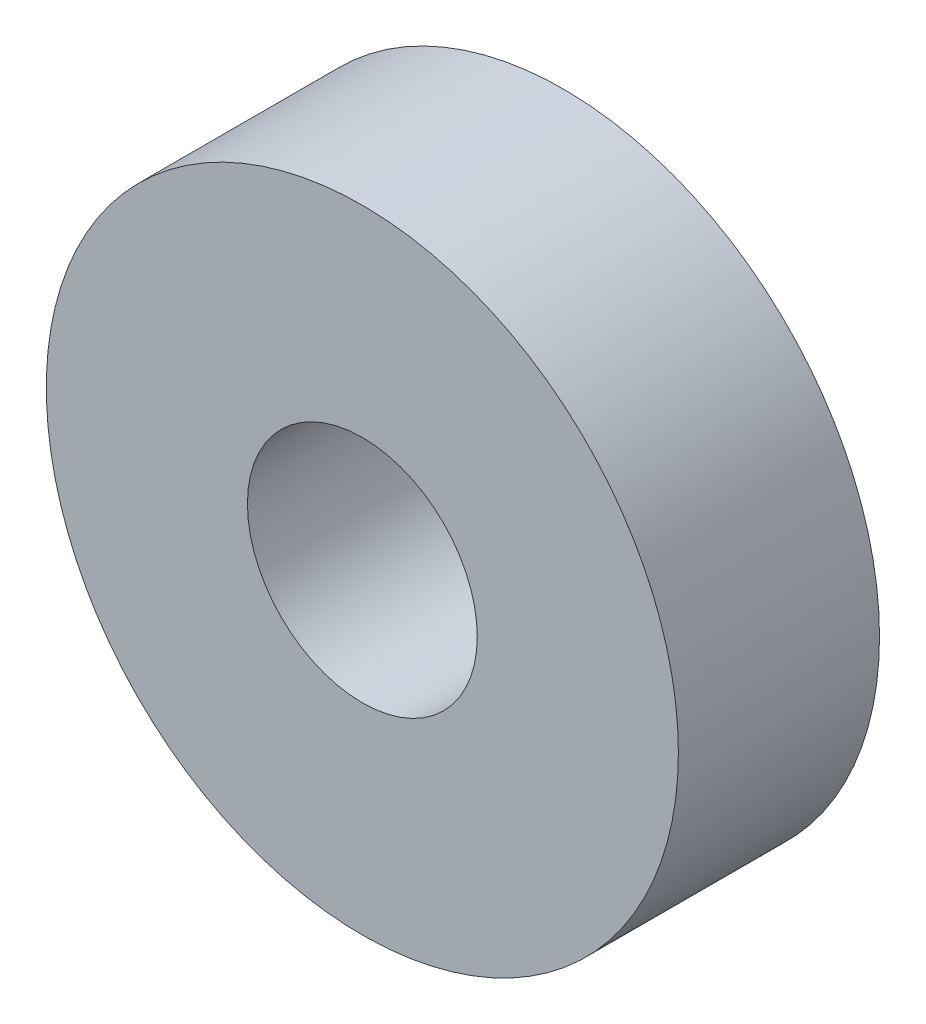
from build123d import *

# Parameters (mm, degrees)
SKETCH1_R           = 11
SKETCH1_R_2         = 4
BOSS_EXTRUDE1_DEPTH = 7


with BuildPart() as part:
    # Sketch1 → Boss-Extrude1 (new body)
    with BuildSketch(Plane.XY):
        with Locations((-129.774280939, -311.683903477)):
            Circle(SKETCH1_R)
        with Locations((-129.774280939, -311.683903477)):
            Circle(SKETCH1_R_2, mode=Mode.SUBTRACT)
    extrude(amount=BOSS_EXTRUDE1_DEPTH)


solid = part.part
